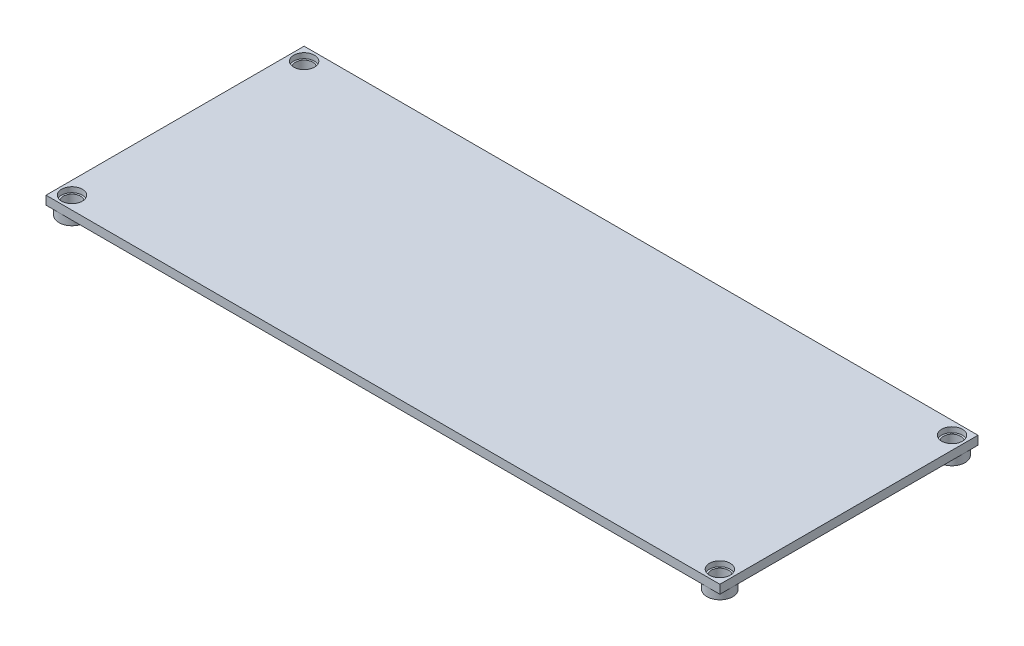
from build123d import *

# Parameters (mm, degrees)
SKETCH_1_W          = 194.5
SKETCH_1_H          = 74.5
EXTRUDE_1_DEPTH     = 2.5
SKETCH_2_R          = 3
CUT_EXTRUDE_2_DEPTH = 1.5
SKETCH_3_R          = 3.75
EXTRUDE_2_DEPTH     = 2.5
CUT_EXTRUDE_3_REACH = 106.199
SKETCH_4_R          = 2.5


with BuildPart() as part:
    # Sketch 1 → Extrude 1 (new body)
    with BuildSketch(Plane(origin=(0, 0, 0), x_dir=(1, 0, 0), z_dir=(0, 1, 0))):
        Rectangle(SKETCH_1_W, SKETCH_1_H)
    extrude(amount=EXTRUDE_1_DEPTH)

    # Sketch 2 → Cut-Extrude 2 (cut)
    with BuildSketch(Plane(origin=(0, 2.5, 0), x_dir=(1, 0, 0), z_dir=(0, 1, 0))):
        with Locations(Location((-93.5, 33.5, 0), (0, 0, 270))):
            Circle(SKETCH_2_R)
        with Locations(Location((93.5, 33.5, 0), (0, 0, 270))):
            Circle(SKETCH_2_R)
        with Locations(Location((93.5, -33.5, 0), (0, 0, 270))):
            Circle(SKETCH_2_R)
        with Locations(Location((-93.5, -33.5, 0), (0, 0, 270))):
            Circle(SKETCH_2_R)
    extrude(amount=-CUT_EXTRUDE_2_DEPTH, mode=Mode.SUBTRACT)

    # Sketch 3 → Extrude 2 (add)
    with BuildSketch(Plane.XZ):
        with Locations(Location((-93.5, 33.5, 0), (0, 0, 90))):
            Circle(SKETCH_3_R)
        with Locations(Location((93.5, -33.5, 0), (0, 0, 270))):
            Circle(SKETCH_3_R)
        with Locations(Location((-93.5, -33.5, 0), (0, 0, 270))):
            Circle(SKETCH_3_R)
        with Locations(Location((93.5, 33.5, 0), (0, 0, 90))):
            Circle(SKETCH_3_R)
    extrude(amount=EXTRUDE_2_DEPTH)

    # Sketch 4 → Cut-Extrude 3 (cut, up to next)
    with BuildSketch(Plane(origin=(0, 1, 0), x_dir=(1, 0, 0), z_dir=(0, 1, 0)), mode=Mode.PRIVATE) as cut_extrude_3_sk1:
        with Locations(Location((-93.5, 33.5, 0), (0, 0, 270))):
            Circle(SKETCH_4_R)
    cut_extrude_3_tool1 = extrude(cut_extrude_3_sk1.sketch, amount=-CUT_EXTRUDE_3_REACH, mode=Mode.PRIVATE) & part.part
    # Sketch 4 → Cut-Extrude 3 (cut, up to next)
    with BuildSketch(Plane(origin=(0, 1, 0), x_dir=(1, 0, 0), z_dir=(0, 1, 0)), mode=Mode.PRIVATE) as cut_extrude_3_sk2:
        with Locations(Location((-93.5, -33.5, 0), (0, 0, 270))):
            Circle(SKETCH_4_R)
    cut_extrude_3_tool2 = extrude(cut_extrude_3_sk2.sketch, amount=-CUT_EXTRUDE_3_REACH, mode=Mode.PRIVATE) & part.part
    # Sketch 4 → Cut-Extrude 3 (cut, up to next)
    with BuildSketch(Plane(origin=(0, 1, 0), x_dir=(1, 0, 0), z_dir=(0, 1, 0)), mode=Mode.PRIVATE) as cut_extrude_3_sk3:
        with Locations(Location((93.5, 33.5, 0), (0, 0, 270))):
            Circle(SKETCH_4_R)
    cut_extrude_3_tool3 = extrude(cut_extrude_3_sk3.sketch, amount=-CUT_EXTRUDE_3_REACH, mode=Mode.PRIVATE) & part.part
    # Sketch 4 → Cut-Extrude 3 (cut, up to next)
    with BuildSketch(Plane(origin=(0, 1, 0), x_dir=(1, 0, 0), z_dir=(0, 1, 0)), mode=Mode.PRIVATE) as cut_extrude_3_sk4:
        with Locations(Location((93.5, -33.5, 0), (0, 0, 270))):
            Circle(SKETCH_4_R)
    cut_extrude_3_tool4 = extrude(cut_extrude_3_sk4.sketch, amount=-CUT_EXTRUDE_3_REACH, mode=Mode.PRIVATE) & part.part
    add(cut_extrude_3_tool1.solids().sort_by_distance((-93.5, 1, -33.5))[0], mode=Mode.SUBTRACT)
    add(cut_extrude_3_tool2.solids().sort_by_distance((-93.5, 1, 33.5))[0], mode=Mode.SUBTRACT)
    add(cut_extrude_3_tool3.solids().sort_by_distance((93.5, 1, -33.5))[0], mode=Mode.SUBTRACT)
    add(cut_extrude_3_tool4.solids().sort_by_distance((93.5, 1, 33.5))[0], mode=Mode.SUBTRACT)


solid = part.part
